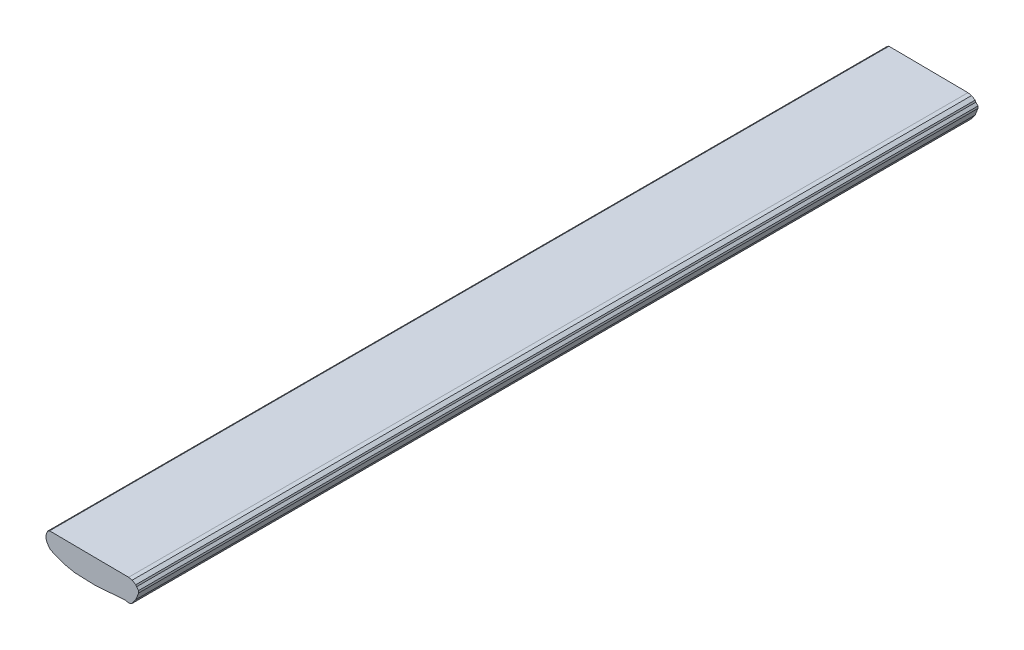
ISO-10303-21;
HEADER;
FILE_DESCRIPTION(('STEP AP214'),'2;1');
FILE_NAME('part.step','',(''),(''),'','','');
FILE_SCHEMA(('AUTOMOTIVE_DESIGN { 1 0 10303 214 1 1 1 1 }'));
ENDSEC;
DATA;
#1=APPLICATION_CONTEXT('core data for automotive mechanical design processes');
#2=APPLICATION_PROTOCOL_DEFINITION('international standard','automotive_design',2000,#1);
#3=PRODUCT_CONTEXT('',#1,'mechanical');
#4=PRODUCT('Part','Part','',(#3));
#5=PRODUCT_RELATED_PRODUCT_CATEGORY('part','',(#4));
#6=PRODUCT_DEFINITION_FORMATION('','',#4);
#7=PRODUCT_DEFINITION_CONTEXT('part definition',#1,'design');
#8=PRODUCT_DEFINITION('design','',#6,#7);
#9=PRODUCT_DEFINITION_SHAPE('','',#8);
#10=(LENGTH_UNIT() NAMED_UNIT(*) SI_UNIT(.MILLI.,.METRE.));
#11=(NAMED_UNIT(*) PLANE_ANGLE_UNIT() SI_UNIT($,.RADIAN.));
#12=(NAMED_UNIT(*) SI_UNIT($,.STERADIAN.) SOLID_ANGLE_UNIT());
#13=UNCERTAINTY_MEASURE_WITH_UNIT(LENGTH_MEASURE(1.E-05),#10,'distance_accuracy_value','');
#14=(GEOMETRIC_REPRESENTATION_CONTEXT(3) GLOBAL_UNCERTAINTY_ASSIGNED_CONTEXT((#13)) GLOBAL_UNIT_ASSIGNED_CONTEXT((#10,
#11,#12)) REPRESENTATION_CONTEXT('',''));
#15=CARTESIAN_POINT('',(0.,0.,0.));
#16=DIRECTION('',(0.,0.,1.));
#17=DIRECTION('',(1.,0.,0.));
#18=AXIS2_PLACEMENT_3D('',#15,#16,#17);
#19=CARTESIAN_POINT('',(575.,150.,-1160.));
#20=DIRECTION('',(-0.554700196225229,0.832050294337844,0.));
#21=DIRECTION('',(-0.832050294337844,-0.554700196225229,0.));
#22=AXIS2_PLACEMENT_3D('',#19,#20,#21);
#23=PLANE('',#22);
#24=DIRECTION('',(-0.832050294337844,-0.554700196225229,0.));
#25=VECTOR('',#24,1.);
#26=CARTESIAN_POINT('',(575.,150.,8.40000000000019));
#27=LINE('',#26,#25);
#28=CARTESIAN_POINT('',(575.,150.,8.40000000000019));
#29=VERTEX_POINT('',#28);
#30=CARTESIAN_POINT('',(572.,148.,8.40000000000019));
#31=VERTEX_POINT('',#30);
#32=EDGE_CURVE('E213',#29,#31,#27,.T.);
#33=ORIENTED_EDGE('',*,*,#32,.F.);
#34=DIRECTION('',(0.,0.,1.));
#35=VECTOR('',#34,1.);
#36=CARTESIAN_POINT('',(575.,150.,-1160.));
#37=LINE('',#36,#35);
#38=CARTESIAN_POINT('',(575.,150.,-1160.));
#39=VERTEX_POINT('',#38);
#40=EDGE_CURVE('E11',#39,#29,#37,.T.);
#41=ORIENTED_EDGE('',*,*,#40,.F.);
#42=DIRECTION('',(-0.832050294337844,-0.554700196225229,0.));
#43=VECTOR('',#42,1.);
#44=CARTESIAN_POINT('',(575.,150.,-1160.));
#45=LINE('',#44,#43);
#46=CARTESIAN_POINT('',(572.,148.,-1160.));
#47=VERTEX_POINT('',#46);
#48=EDGE_CURVE('E275',#39,#47,#45,.T.);
#49=ORIENTED_EDGE('',*,*,#48,.T.);
#50=DIRECTION('',(0.,0.,1.));
#51=VECTOR('',#50,1.);
#52=CARTESIAN_POINT('',(572.,148.,-1160.));
#53=LINE('',#52,#51);
#54=EDGE_CURVE('E35',#47,#31,#53,.T.);
#55=ORIENTED_EDGE('',*,*,#54,.T.);
#56=EDGE_LOOP('',(#33,#41,#49,#55));
#57=FACE_BOUND('',#56,.T.);
#58=ADVANCED_FACE('F32',(#57),#23,.T.);
#59=CARTESIAN_POINT('',(685.,149.,-1160.));
#60=DIRECTION('',(0.0090905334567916,0.999958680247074,0.));
#61=DIRECTION('',(-0.999958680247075,0.0090905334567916,0.));
#62=AXIS2_PLACEMENT_3D('',#59,#60,#61);
#63=PLANE('',#62);
#64=DIRECTION('',(-0.999958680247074,0.0090905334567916,0.));
#65=VECTOR('',#64,1.);
#66=CARTESIAN_POINT('',(685.,149.,8.40000000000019));
#67=LINE('',#66,#65);
#68=CARTESIAN_POINT('',(685.,149.,8.40000000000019));
#69=VERTEX_POINT('',#68);
#70=EDGE_CURVE('E273',#69,#29,#67,.T.);
#71=ORIENTED_EDGE('',*,*,#70,.F.);
#72=DIRECTION('',(0.,0.,1.));
#73=VECTOR('',#72,1.);
#74=CARTESIAN_POINT('',(685.,149.,-1160.));
#75=LINE('',#74,#73);
#76=CARTESIAN_POINT('',(685.,149.,-1160.));
#77=VERTEX_POINT('',#76);
#78=EDGE_CURVE('E41',#77,#69,#75,.T.);
#79=ORIENTED_EDGE('',*,*,#78,.F.);
#80=DIRECTION('',(-0.999958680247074,0.0090905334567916,0.));
#81=VECTOR('',#80,1.);
#82=CARTESIAN_POINT('',(685.,149.,-1160.));
#83=LINE('',#82,#81);
#84=EDGE_CURVE('E203',#77,#39,#83,.T.);
#85=ORIENTED_EDGE('',*,*,#84,.T.);
#86=ORIENTED_EDGE('',*,*,#40,.T.);
#87=EDGE_LOOP('',(#71,#79,#85,#86));
#88=FACE_BOUND('',#87,.T.);
#89=ADVANCED_FACE('F315',(#88),#63,.T.);
#90=CARTESIAN_POINT('',(690.,148.,-1160.));
#91=DIRECTION('',(0.196116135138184,0.98058067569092,0.));
#92=DIRECTION('',(-0.98058067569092,0.196116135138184,0.));
#93=AXIS2_PLACEMENT_3D('',#90,#91,#92);
#94=PLANE('',#93);
#95=DIRECTION('',(-0.98058067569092,0.196116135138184,0.));
#96=VECTOR('',#95,1.);
#97=CARTESIAN_POINT('',(690.,148.,8.40000000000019));
#98=LINE('',#97,#96);
#99=CARTESIAN_POINT('',(690.,148.,8.40000000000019));
#100=VERTEX_POINT('',#99);
#101=EDGE_CURVE('E190',#100,#69,#98,.T.);
#102=ORIENTED_EDGE('',*,*,#101,.F.);
#103=DIRECTION('',(0.,0.,1.));
#104=VECTOR('',#103,1.);
#105=CARTESIAN_POINT('',(690.,148.,-1160.));
#106=LINE('',#105,#104);
#107=CARTESIAN_POINT('',(690.,148.,-1160.));
#108=VERTEX_POINT('',#107);
#109=EDGE_CURVE('E185',#108,#100,#106,.T.);
#110=ORIENTED_EDGE('',*,*,#109,.F.);
#111=DIRECTION('',(-0.98058067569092,0.196116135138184,0.));
#112=VECTOR('',#111,1.);
#113=CARTESIAN_POINT('',(690.,148.,-1160.));
#114=LINE('',#113,#112);
#115=EDGE_CURVE('E188',#108,#77,#114,.T.);
#116=ORIENTED_EDGE('',*,*,#115,.T.);
#117=ORIENTED_EDGE('',*,*,#78,.T.);
#118=EDGE_LOOP('',(#102,#110,#116,#117));
#119=FACE_BOUND('',#118,.T.);
#120=ADVANCED_FACE('F187',(#119),#94,.T.);
#121=CARTESIAN_POINT('',(695.,145.,-1160.));
#122=DIRECTION('',(0.514495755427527,0.857492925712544,0.));
#123=DIRECTION('',(-0.857492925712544,0.514495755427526,0.));
#124=AXIS2_PLACEMENT_3D('',#121,#122,#123);
#125=PLANE('',#124);
#126=DIRECTION('',(-0.857492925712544,0.514495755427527,0.));
#127=VECTOR('',#126,1.);
#128=CARTESIAN_POINT('',(695.,145.,8.40000000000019));
#129=LINE('',#128,#127);
#130=CARTESIAN_POINT('',(695.,145.,8.40000000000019));
#131=VERTEX_POINT('',#130);
#132=EDGE_CURVE('E270',#131,#100,#129,.T.);
#133=ORIENTED_EDGE('',*,*,#132,.F.);
#134=DIRECTION('',(0.,0.,1.));
#135=VECTOR('',#134,1.);
#136=CARTESIAN_POINT('',(695.,145.,-1160.));
#137=LINE('',#136,#135);
#138=CARTESIAN_POINT('',(695.,145.,-1160.));
#139=VERTEX_POINT('',#138);
#140=EDGE_CURVE('E195',#139,#131,#137,.T.);
#141=ORIENTED_EDGE('',*,*,#140,.F.);
#142=DIRECTION('',(-0.857492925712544,0.514495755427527,0.));
#143=VECTOR('',#142,1.);
#144=CARTESIAN_POINT('',(695.,145.,-1160.));
#145=LINE('',#144,#143);
#146=EDGE_CURVE('E201',#139,#108,#145,.T.);
#147=ORIENTED_EDGE('',*,*,#146,.T.);
#148=ORIENTED_EDGE('',*,*,#109,.T.);
#149=EDGE_LOOP('',(#133,#141,#147,#148));
#150=FACE_BOUND('',#149,.T.);
#151=ADVANCED_FACE('F205',(#150),#125,.T.);
#152=CARTESIAN_POINT('',(696.,143.,-1160.));
#153=DIRECTION('',(0.894427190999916,0.447213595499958,0.));
#154=DIRECTION('',(-0.447213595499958,0.894427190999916,0.));
#155=AXIS2_PLACEMENT_3D('',#152,#153,#154);
#156=PLANE('',#155);
#157=DIRECTION('',(-0.447213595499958,0.894427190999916,0.));
#158=VECTOR('',#157,1.);
#159=CARTESIAN_POINT('',(696.,143.,8.40000000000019));
#160=LINE('',#159,#158);
#161=CARTESIAN_POINT('',(696.,143.,8.40000000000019));
#162=VERTEX_POINT('',#161);
#163=EDGE_CURVE('E267',#162,#131,#160,.T.);
#164=ORIENTED_EDGE('',*,*,#163,.F.);
#165=DIRECTION('',(0.,0.,1.));
#166=VECTOR('',#165,1.);
#167=CARTESIAN_POINT('',(696.,143.,-1160.));
#168=LINE('',#167,#166);
#169=CARTESIAN_POINT('',(696.,143.,-1160.));
#170=VERTEX_POINT('',#169);
#171=EDGE_CURVE('E279',#170,#162,#168,.T.);
#172=ORIENTED_EDGE('',*,*,#171,.F.);
#173=DIRECTION('',(-0.447213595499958,0.894427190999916,0.));
#174=VECTOR('',#173,1.);
#175=CARTESIAN_POINT('',(696.,143.,-1160.));
#176=LINE('',#175,#174);
#177=EDGE_CURVE('E206',#170,#139,#176,.T.);
#178=ORIENTED_EDGE('',*,*,#177,.T.);
#179=ORIENTED_EDGE('',*,*,#140,.T.);
#180=EDGE_LOOP('',(#164,#172,#178,#179));
#181=FACE_BOUND('',#180,.T.);
#182=ADVANCED_FACE('F328',(#181),#156,.T.);
#183=CARTESIAN_POINT('',(699.,140.,-1160.));
#184=DIRECTION('',(0.707106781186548,0.707106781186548,0.));
#185=DIRECTION('',(-0.707106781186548,0.707106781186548,0.));
#186=AXIS2_PLACEMENT_3D('',#183,#184,#185);
#187=PLANE('',#186);
#188=DIRECTION('',(-0.707106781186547,0.707106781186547,0.));
#189=VECTOR('',#188,1.);
#190=CARTESIAN_POINT('',(699.,140.,8.40000000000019));
#191=LINE('',#190,#189);
#192=CARTESIAN_POINT('',(699.,140.,8.40000000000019));
#193=VERTEX_POINT('',#192);
#194=EDGE_CURVE('E264',#193,#162,#191,.T.);
#195=ORIENTED_EDGE('',*,*,#194,.F.);
#196=DIRECTION('',(0.,0.,1.));
#197=VECTOR('',#196,1.);
#198=CARTESIAN_POINT('',(699.,140.,-1160.));
#199=LINE('',#198,#197);
#200=CARTESIAN_POINT('',(699.,140.,-1160.));
#201=VERTEX_POINT('',#200);
#202=EDGE_CURVE('E281',#201,#193,#199,.T.);
#203=ORIENTED_EDGE('',*,*,#202,.F.);
#204=DIRECTION('',(-0.707106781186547,0.707106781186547,0.));
#205=VECTOR('',#204,1.);
#206=CARTESIAN_POINT('',(699.,140.,-1160.));
#207=LINE('',#206,#205);
#208=EDGE_CURVE('E208',#201,#170,#207,.T.);
#209=ORIENTED_EDGE('',*,*,#208,.T.);
#210=ORIENTED_EDGE('',*,*,#171,.T.);
#211=EDGE_LOOP('',(#195,#203,#209,#210));
#212=FACE_BOUND('',#211,.T.);
#213=ADVANCED_FACE('F331',(#212),#187,.T.);
#214=CARTESIAN_POINT('',(699.,137.,-1160.));
#215=DIRECTION('',(1.,0.,0.));
#216=DIRECTION('',(0.,0.,-1.));
#217=AXIS2_PLACEMENT_3D('',#214,#215,#216);
#218=PLANE('',#217);
#219=DIRECTION('',(0.,1.,0.));
#220=VECTOR('',#219,1.);
#221=CARTESIAN_POINT('',(699.,137.,8.40000000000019));
#222=LINE('',#221,#220);
#223=CARTESIAN_POINT('',(699.,137.,8.40000000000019));
#224=VERTEX_POINT('',#223);
#225=EDGE_CURVE('E261',#224,#193,#222,.T.);
#226=ORIENTED_EDGE('',*,*,#225,.F.);
#227=DIRECTION('',(0.,0.,1.));
#228=VECTOR('',#227,1.);
#229=CARTESIAN_POINT('',(699.,137.,-1160.));
#230=LINE('',#229,#228);
#231=CARTESIAN_POINT('',(699.,137.,-1160.));
#232=VERTEX_POINT('',#231);
#233=EDGE_CURVE('E283',#232,#224,#230,.T.);
#234=ORIENTED_EDGE('',*,*,#233,.F.);
#235=DIRECTION('',(0.,1.,0.));
#236=VECTOR('',#235,1.);
#237=CARTESIAN_POINT('',(699.,137.,-1160.));
#238=LINE('',#237,#236);
#239=EDGE_CURVE('E594',#232,#201,#238,.T.);
#240=ORIENTED_EDGE('',*,*,#239,.T.);
#241=ORIENTED_EDGE('',*,*,#202,.T.);
#242=EDGE_LOOP('',(#226,#234,#240,#241));
#243=FACE_BOUND('',#242,.T.);
#244=ADVANCED_FACE('F335',(#243),#218,.T.);
#245=CARTESIAN_POINT('',(695.,127.,-1160.));
#246=DIRECTION('',(0.928476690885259,-0.371390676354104,0.));
#247=DIRECTION('',(0.371390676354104,0.928476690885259,0.));
#248=AXIS2_PLACEMENT_3D('',#245,#246,#247);
#249=PLANE('',#248);
#250=DIRECTION('',(0.371390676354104,0.928476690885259,0.));
#251=VECTOR('',#250,1.);
#252=CARTESIAN_POINT('',(695.,127.,8.40000000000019));
#253=LINE('',#252,#251);
#254=CARTESIAN_POINT('',(695.,127.,8.40000000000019));
#255=VERTEX_POINT('',#254);
#256=EDGE_CURVE('E258',#255,#224,#253,.T.);
#257=ORIENTED_EDGE('',*,*,#256,.F.);
#258=DIRECTION('',(0.,0.,1.));
#259=VECTOR('',#258,1.);
#260=CARTESIAN_POINT('',(695.,127.,-1160.));
#261=LINE('',#260,#259);
#262=CARTESIAN_POINT('',(695.,127.,-1160.));
#263=VERTEX_POINT('',#262);
#264=EDGE_CURVE('E285',#263,#255,#261,.T.);
#265=ORIENTED_EDGE('',*,*,#264,.F.);
#266=DIRECTION('',(0.371390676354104,0.928476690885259,0.));
#267=VECTOR('',#266,1.);
#268=CARTESIAN_POINT('',(695.,127.,-1160.));
#269=LINE('',#268,#267);
#270=EDGE_CURVE('E590',#263,#232,#269,.T.);
#271=ORIENTED_EDGE('',*,*,#270,.T.);
#272=ORIENTED_EDGE('',*,*,#233,.T.);
#273=EDGE_LOOP('',(#257,#265,#271,#272));
#274=FACE_BOUND('',#273,.T.);
#275=ADVANCED_FACE('F339',(#274),#249,.T.);
#276=CARTESIAN_POINT('',(689.,119.,-1160.));
#277=DIRECTION('',(0.799999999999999,-0.600000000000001,0.));
#278=DIRECTION('',(0.600000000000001,0.799999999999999,0.));
#279=AXIS2_PLACEMENT_3D('',#276,#277,#278);
#280=PLANE('',#279);
#281=DIRECTION('',(0.600000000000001,0.799999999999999,0.));
#282=VECTOR('',#281,1.);
#283=CARTESIAN_POINT('',(689.,119.,8.40000000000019));
#284=LINE('',#283,#282);
#285=CARTESIAN_POINT('',(689.,119.,8.40000000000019));
#286=VERTEX_POINT('',#285);
#287=EDGE_CURVE('E255',#286,#255,#284,.T.);
#288=ORIENTED_EDGE('',*,*,#287,.F.);
#289=DIRECTION('',(0.,0.,1.));
#290=VECTOR('',#289,1.);
#291=CARTESIAN_POINT('',(689.,119.,-1160.));
#292=LINE('',#291,#290);
#293=CARTESIAN_POINT('',(689.,119.,-1160.));
#294=VERTEX_POINT('',#293);
#295=EDGE_CURVE('E287',#294,#286,#292,.T.);
#296=ORIENTED_EDGE('',*,*,#295,.F.);
#297=DIRECTION('',(0.600000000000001,0.799999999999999,0.));
#298=VECTOR('',#297,1.);
#299=CARTESIAN_POINT('',(689.,119.,-1160.));
#300=LINE('',#299,#298);
#301=EDGE_CURVE('E601',#294,#263,#300,.T.);
#302=ORIENTED_EDGE('',*,*,#301,.T.);
#303=ORIENTED_EDGE('',*,*,#264,.T.);
#304=EDGE_LOOP('',(#288,#296,#302,#303));
#305=FACE_BOUND('',#304,.T.);
#306=ADVANCED_FACE('F343',(#305),#280,.T.);
#307=CARTESIAN_POINT('',(685.,118.,-1160.));
#308=DIRECTION('',(0.242535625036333,-0.970142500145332,0.));
#309=DIRECTION('',(0.970142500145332,0.242535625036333,0.));
#310=AXIS2_PLACEMENT_3D('',#307,#308,#309);
#311=PLANE('',#310);
#312=DIRECTION('',(0.970142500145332,0.242535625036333,0.));
#313=VECTOR('',#312,1.);
#314=CARTESIAN_POINT('',(685.,118.,8.40000000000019));
#315=LINE('',#314,#313);
#316=CARTESIAN_POINT('',(685.,118.,8.40000000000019));
#317=VERTEX_POINT('',#316);
#318=EDGE_CURVE('E252',#317,#286,#315,.T.);
#319=ORIENTED_EDGE('',*,*,#318,.F.);
#320=DIRECTION('',(0.,0.,1.));
#321=VECTOR('',#320,1.);
#322=CARTESIAN_POINT('',(685.,118.,-1160.));
#323=LINE('',#322,#321);
#324=CARTESIAN_POINT('',(685.,118.,-1160.));
#325=VERTEX_POINT('',#324);
#326=EDGE_CURVE('E289',#325,#317,#323,.T.);
#327=ORIENTED_EDGE('',*,*,#326,.F.);
#328=DIRECTION('',(0.970142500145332,0.242535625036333,0.));
#329=VECTOR('',#328,1.);
#330=CARTESIAN_POINT('',(685.,118.,-1160.));
#331=LINE('',#330,#329);
#332=EDGE_CURVE('E583',#325,#294,#331,.T.);
#333=ORIENTED_EDGE('',*,*,#332,.T.);
#334=ORIENTED_EDGE('',*,*,#295,.T.);
#335=EDGE_LOOP('',(#319,#327,#333,#334));
#336=FACE_BOUND('',#335,.T.);
#337=ADVANCED_FACE('F347',(#336),#311,.T.);
#338=CARTESIAN_POINT('',(681.,119.,-1160.));
#339=DIRECTION('',(-0.242535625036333,-0.970142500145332,0.));
#340=DIRECTION('',(0.970142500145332,-0.242535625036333,0.));
#341=AXIS2_PLACEMENT_3D('',#338,#339,#340);
#342=PLANE('',#341);
#343=DIRECTION('',(0.970142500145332,-0.242535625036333,0.));
#344=VECTOR('',#343,1.);
#345=CARTESIAN_POINT('',(681.,119.,8.40000000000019));
#346=LINE('',#345,#344);
#347=CARTESIAN_POINT('',(681.,119.,8.40000000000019));
#348=VERTEX_POINT('',#347);
#349=EDGE_CURVE('E249',#348,#317,#346,.T.);
#350=ORIENTED_EDGE('',*,*,#349,.F.);
#351=DIRECTION('',(0.,0.,1.));
#352=VECTOR('',#351,1.);
#353=CARTESIAN_POINT('',(681.,119.,-1160.));
#354=LINE('',#353,#352);
#355=CARTESIAN_POINT('',(681.,119.,-1160.));
#356=VERTEX_POINT('',#355);
#357=EDGE_CURVE('E291',#356,#348,#354,.T.);
#358=ORIENTED_EDGE('',*,*,#357,.F.);
#359=DIRECTION('',(0.970142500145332,-0.242535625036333,0.));
#360=VECTOR('',#359,1.);
#361=CARTESIAN_POINT('',(681.,119.,-1160.));
#362=LINE('',#361,#360);
#363=EDGE_CURVE('E579',#356,#325,#362,.T.);
#364=ORIENTED_EDGE('',*,*,#363,.T.);
#365=ORIENTED_EDGE('',*,*,#326,.T.);
#366=EDGE_LOOP('',(#350,#358,#364,#365));
#367=FACE_BOUND('',#366,.T.);
#368=ADVANCED_FACE('F351',(#367),#342,.T.);
#369=CARTESIAN_POINT('',(637.,116.,-1160.));
#370=DIRECTION('',(0.0680238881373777,-0.99768369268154,0.));
#371=DIRECTION('',(0.99768369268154,0.0680238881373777,0.));
#372=AXIS2_PLACEMENT_3D('',#369,#370,#371);
#373=PLANE('',#372);
#374=DIRECTION('',(0.99768369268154,0.0680238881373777,0.));
#375=VECTOR('',#374,1.);
#376=CARTESIAN_POINT('',(637.,116.,8.40000000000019));
#377=LINE('',#376,#375);
#378=CARTESIAN_POINT('',(637.,116.,8.40000000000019));
#379=VERTEX_POINT('',#378);
#380=EDGE_CURVE('E246',#379,#348,#377,.T.);
#381=ORIENTED_EDGE('',*,*,#380,.F.);
#382=DIRECTION('',(0.,0.,1.));
#383=VECTOR('',#382,1.);
#384=CARTESIAN_POINT('',(637.,116.,-1160.));
#385=LINE('',#384,#383);
#386=CARTESIAN_POINT('',(637.,116.,-1160.));
#387=VERTEX_POINT('',#386);
#388=EDGE_CURVE('E293',#387,#379,#385,.T.);
#389=ORIENTED_EDGE('',*,*,#388,.F.);
#390=DIRECTION('',(0.99768369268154,0.0680238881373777,0.));
#391=VECTOR('',#390,1.);
#392=CARTESIAN_POINT('',(637.,116.,-1160.));
#393=LINE('',#392,#391);
#394=EDGE_CURVE('E605',#387,#356,#393,.T.);
#395=ORIENTED_EDGE('',*,*,#394,.T.);
#396=ORIENTED_EDGE('',*,*,#357,.T.);
#397=EDGE_LOOP('',(#381,#389,#395,#396));
#398=FACE_BOUND('',#397,.T.);
#399=ADVANCED_FACE('F355',(#398),#373,.T.);
#400=CARTESIAN_POINT('',(610.,117.,-1160.));
#401=DIRECTION('',(-0.0370116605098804,-0.999314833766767,0.));
#402=DIRECTION('',(0.999314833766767,-0.0370116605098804,0.));
#403=AXIS2_PLACEMENT_3D('',#400,#401,#402);
#404=PLANE('',#403);
#405=DIRECTION('',(0.999314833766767,-0.0370116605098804,0.));
#406=VECTOR('',#405,1.);
#407=CARTESIAN_POINT('',(610.,117.,8.40000000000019));
#408=LINE('',#407,#406);
#409=CARTESIAN_POINT('',(610.,117.,8.40000000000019));
#410=VERTEX_POINT('',#409);
#411=EDGE_CURVE('E243',#410,#379,#408,.T.);
#412=ORIENTED_EDGE('',*,*,#411,.F.);
#413=DIRECTION('',(0.,0.,1.));
#414=VECTOR('',#413,1.);
#415=CARTESIAN_POINT('',(610.,117.,-1160.));
#416=LINE('',#415,#414);
#417=CARTESIAN_POINT('',(610.,117.,-1160.));
#418=VERTEX_POINT('',#417);
#419=EDGE_CURVE('E295',#418,#410,#416,.T.);
#420=ORIENTED_EDGE('',*,*,#419,.F.);
#421=DIRECTION('',(0.999314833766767,-0.0370116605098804,0.));
#422=VECTOR('',#421,1.);
#423=CARTESIAN_POINT('',(610.,117.,-1160.));
#424=LINE('',#423,#422);
#425=EDGE_CURVE('E572',#418,#387,#424,.T.);
#426=ORIENTED_EDGE('',*,*,#425,.T.);
#427=ORIENTED_EDGE('',*,*,#388,.T.);
#428=EDGE_LOOP('',(#412,#420,#426,#427));
#429=FACE_BOUND('',#428,.T.);
#430=ADVANCED_FACE('F359',(#429),#404,.T.);
#431=CARTESIAN_POINT('',(596.,120.,-1160.));
#432=DIRECTION('',(-0.209529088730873,-0.977802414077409,0.));
#433=DIRECTION('',(0.97780241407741,-0.209529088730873,0.));
#434=AXIS2_PLACEMENT_3D('',#431,#432,#433);
#435=PLANE('',#434);
#436=DIRECTION('',(0.97780241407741,-0.209529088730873,0.));
#437=VECTOR('',#436,1.);
#438=CARTESIAN_POINT('',(596.,120.,8.40000000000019));
#439=LINE('',#438,#437);
#440=CARTESIAN_POINT('',(596.,120.,8.40000000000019));
#441=VERTEX_POINT('',#440);
#442=EDGE_CURVE('E240',#441,#410,#439,.T.);
#443=ORIENTED_EDGE('',*,*,#442,.F.);
#444=DIRECTION('',(0.,0.,1.));
#445=VECTOR('',#444,1.);
#446=CARTESIAN_POINT('',(596.,120.,-1160.));
#447=LINE('',#446,#445);
#448=CARTESIAN_POINT('',(596.,120.,-1160.));
#449=VERTEX_POINT('',#448);
#450=EDGE_CURVE('E297',#449,#441,#447,.T.);
#451=ORIENTED_EDGE('',*,*,#450,.F.);
#452=DIRECTION('',(0.97780241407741,-0.209529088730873,0.));
#453=VECTOR('',#452,1.);
#454=CARTESIAN_POINT('',(596.,120.,-1160.));
#455=LINE('',#454,#453);
#456=EDGE_CURVE('E568',#449,#418,#455,.T.);
#457=ORIENTED_EDGE('',*,*,#456,.T.);
#458=ORIENTED_EDGE('',*,*,#419,.T.);
#459=EDGE_LOOP('',(#443,#451,#457,#458));
#460=FACE_BOUND('',#459,.T.);
#461=ADVANCED_FACE('F363',(#460),#435,.T.);
#462=CARTESIAN_POINT('',(585.,124.,-1160.));
#463=DIRECTION('',(-0.341743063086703,-0.939793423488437,0.));
#464=DIRECTION('',(0.939793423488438,-0.341743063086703,0.));
#465=AXIS2_PLACEMENT_3D('',#462,#463,#464);
#466=PLANE('',#465);
#467=DIRECTION('',(0.939793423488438,-0.341743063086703,0.));
#468=VECTOR('',#467,1.);
#469=CARTESIAN_POINT('',(585.,124.,8.40000000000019));
#470=LINE('',#469,#468);
#471=CARTESIAN_POINT('',(585.,124.,8.40000000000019));
#472=VERTEX_POINT('',#471);
#473=EDGE_CURVE('E237',#472,#441,#470,.T.);
#474=ORIENTED_EDGE('',*,*,#473,.F.);
#475=DIRECTION('',(0.,0.,1.));
#476=VECTOR('',#475,1.);
#477=CARTESIAN_POINT('',(585.,124.,-1160.));
#478=LINE('',#477,#476);
#479=CARTESIAN_POINT('',(585.,124.,-1160.));
#480=VERTEX_POINT('',#479);
#481=EDGE_CURVE('E299',#480,#472,#478,.T.);
#482=ORIENTED_EDGE('',*,*,#481,.F.);
#483=DIRECTION('',(0.939793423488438,-0.341743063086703,0.));
#484=VECTOR('',#483,1.);
#485=CARTESIAN_POINT('',(585.,124.,-1160.));
#486=LINE('',#485,#484);
#487=EDGE_CURVE('E609',#480,#449,#486,.T.);
#488=ORIENTED_EDGE('',*,*,#487,.T.);
#489=ORIENTED_EDGE('',*,*,#450,.T.);
#490=EDGE_LOOP('',(#474,#482,#488,#489));
#491=FACE_BOUND('',#490,.T.);
#492=ADVANCED_FACE('F367',(#491),#466,.T.);
#493=CARTESIAN_POINT('',(580.,126.,-1160.));
#494=DIRECTION('',(-0.371390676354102,-0.92847669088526,0.));
#495=DIRECTION('',(0.92847669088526,-0.371390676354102,0.));
#496=AXIS2_PLACEMENT_3D('',#493,#494,#495);
#497=PLANE('',#496);
#498=DIRECTION('',(0.92847669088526,-0.371390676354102,0.));
#499=VECTOR('',#498,1.);
#500=CARTESIAN_POINT('',(580.,126.,8.40000000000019));
#501=LINE('',#500,#499);
#502=CARTESIAN_POINT('',(580.,126.,8.40000000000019));
#503=VERTEX_POINT('',#502);
#504=EDGE_CURVE('E234',#503,#472,#501,.T.);
#505=ORIENTED_EDGE('',*,*,#504,.F.);
#506=DIRECTION('',(0.,0.,1.));
#507=VECTOR('',#506,1.);
#508=CARTESIAN_POINT('',(580.,126.,-1160.));
#509=LINE('',#508,#507);
#510=CARTESIAN_POINT('',(580.,126.,-1160.));
#511=VERTEX_POINT('',#510);
#512=EDGE_CURVE('E301',#511,#503,#509,.T.);
#513=ORIENTED_EDGE('',*,*,#512,.F.);
#514=DIRECTION('',(0.92847669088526,-0.371390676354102,0.));
#515=VECTOR('',#514,1.);
#516=CARTESIAN_POINT('',(580.,126.,-1160.));
#517=LINE('',#516,#515);
#518=EDGE_CURVE('E561',#511,#480,#517,.T.);
#519=ORIENTED_EDGE('',*,*,#518,.T.);
#520=ORIENTED_EDGE('',*,*,#481,.T.);
#521=EDGE_LOOP('',(#505,#513,#519,#520));
#522=FACE_BOUND('',#521,.T.);
#523=ADVANCED_FACE('F371',(#522),#497,.T.);
#524=CARTESIAN_POINT('',(576.,128.,-1160.));
#525=DIRECTION('',(-0.447213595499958,-0.894427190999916,0.));
#526=DIRECTION('',(0.894427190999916,-0.447213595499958,0.));
#527=AXIS2_PLACEMENT_3D('',#524,#525,#526);
#528=PLANE('',#527);
#529=DIRECTION('',(0.894427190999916,-0.447213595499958,0.));
#530=VECTOR('',#529,1.);
#531=CARTESIAN_POINT('',(576.,128.,8.40000000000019));
#532=LINE('',#531,#530);
#533=CARTESIAN_POINT('',(576.,128.,8.40000000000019));
#534=VERTEX_POINT('',#533);
#535=EDGE_CURVE('E231',#534,#503,#532,.T.);
#536=ORIENTED_EDGE('',*,*,#535,.F.);
#537=DIRECTION('',(0.,0.,1.));
#538=VECTOR('',#537,1.);
#539=CARTESIAN_POINT('',(576.,128.,-1160.));
#540=LINE('',#539,#538);
#541=CARTESIAN_POINT('',(576.,128.,-1160.));
#542=VERTEX_POINT('',#541);
#543=EDGE_CURVE('E303',#542,#534,#540,.T.);
#544=ORIENTED_EDGE('',*,*,#543,.F.);
#545=DIRECTION('',(0.894427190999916,-0.447213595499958,0.));
#546=VECTOR('',#545,1.);
#547=CARTESIAN_POINT('',(576.,128.,-1160.));
#548=LINE('',#547,#546);
#549=EDGE_CURVE('E557',#542,#511,#548,.T.);
#550=ORIENTED_EDGE('',*,*,#549,.T.);
#551=ORIENTED_EDGE('',*,*,#512,.T.);
#552=EDGE_LOOP('',(#536,#544,#550,#551));
#553=FACE_BOUND('',#552,.T.);
#554=ADVANCED_FACE('F375',(#553),#528,.T.);
#555=CARTESIAN_POINT('',(574.,130.,-1160.));
#556=DIRECTION('',(-0.707106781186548,-0.707106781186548,0.));
#557=DIRECTION('',(0.707106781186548,-0.707106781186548,0.));
#558=AXIS2_PLACEMENT_3D('',#555,#556,#557);
#559=PLANE('',#558);
#560=DIRECTION('',(0.707106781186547,-0.707106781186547,0.));
#561=VECTOR('',#560,1.);
#562=CARTESIAN_POINT('',(574.,130.,8.40000000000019));
#563=LINE('',#562,#561);
#564=CARTESIAN_POINT('',(574.,130.,8.40000000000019));
#565=VERTEX_POINT('',#564);
#566=EDGE_CURVE('E228',#565,#534,#563,.T.);
#567=ORIENTED_EDGE('',*,*,#566,.F.);
#568=DIRECTION('',(0.,0.,1.));
#569=VECTOR('',#568,1.);
#570=CARTESIAN_POINT('',(574.,130.,-1160.));
#571=LINE('',#570,#569);
#572=CARTESIAN_POINT('',(574.,130.,-1160.));
#573=VERTEX_POINT('',#572);
#574=EDGE_CURVE('E305',#573,#565,#571,.T.);
#575=ORIENTED_EDGE('',*,*,#574,.F.);
#576=DIRECTION('',(0.707106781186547,-0.707106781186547,0.));
#577=VECTOR('',#576,1.);
#578=CARTESIAN_POINT('',(574.,130.,-1160.));
#579=LINE('',#578,#577);
#580=EDGE_CURVE('E613',#573,#542,#579,.T.);
#581=ORIENTED_EDGE('',*,*,#580,.T.);
#582=ORIENTED_EDGE('',*,*,#543,.T.);
#583=EDGE_LOOP('',(#567,#575,#581,#582));
#584=FACE_BOUND('',#583,.T.);
#585=ADVANCED_FACE('F379',(#584),#559,.T.);
#586=CARTESIAN_POINT('',(571.,135.,-1160.));
#587=DIRECTION('',(-0.857492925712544,-0.514495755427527,0.));
#588=DIRECTION('',(0.514495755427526,-0.857492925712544,0.));
#589=AXIS2_PLACEMENT_3D('',#586,#587,#588);
#590=PLANE('',#589);
#591=DIRECTION('',(0.514495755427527,-0.857492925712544,0.));
#592=VECTOR('',#591,1.);
#593=CARTESIAN_POINT('',(571.,135.,8.40000000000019));
#594=LINE('',#593,#592);
#595=CARTESIAN_POINT('',(571.,135.,8.40000000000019));
#596=VERTEX_POINT('',#595);
#597=EDGE_CURVE('E225',#596,#565,#594,.T.);
#598=ORIENTED_EDGE('',*,*,#597,.F.);
#599=DIRECTION('',(0.,0.,1.));
#600=VECTOR('',#599,1.);
#601=CARTESIAN_POINT('',(571.,135.,-1160.));
#602=LINE('',#601,#600);
#603=CARTESIAN_POINT('',(571.,135.,-1160.));
#604=VERTEX_POINT('',#603);
#605=EDGE_CURVE('E307',#604,#596,#602,.T.);
#606=ORIENTED_EDGE('',*,*,#605,.F.);
#607=DIRECTION('',(0.514495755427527,-0.857492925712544,0.));
#608=VECTOR('',#607,1.);
#609=CARTESIAN_POINT('',(571.,135.,-1160.));
#610=LINE('',#609,#608);
#611=EDGE_CURVE('E550',#604,#573,#610,.T.);
#612=ORIENTED_EDGE('',*,*,#611,.T.);
#613=ORIENTED_EDGE('',*,*,#574,.T.);
#614=EDGE_LOOP('',(#598,#606,#612,#613));
#615=FACE_BOUND('',#614,.T.);
#616=ADVANCED_FACE('F383',(#615),#590,.T.);
#617=CARTESIAN_POINT('',(570.,138.,-1160.));
#618=DIRECTION('',(-0.948683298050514,-0.316227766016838,0.));
#619=DIRECTION('',(0.316227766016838,-0.948683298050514,0.));
#620=AXIS2_PLACEMENT_3D('',#617,#618,#619);
#621=PLANE('',#620);
#622=DIRECTION('',(0.316227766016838,-0.948683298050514,0.));
#623=VECTOR('',#622,1.);
#624=CARTESIAN_POINT('',(570.,138.,8.40000000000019));
#625=LINE('',#624,#623);
#626=CARTESIAN_POINT('',(570.,138.,8.40000000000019));
#627=VERTEX_POINT('',#626);
#628=EDGE_CURVE('E222',#627,#596,#625,.T.);
#629=ORIENTED_EDGE('',*,*,#628,.F.);
#630=DIRECTION('',(0.,0.,1.));
#631=VECTOR('',#630,1.);
#632=CARTESIAN_POINT('',(570.,138.,-1160.));
#633=LINE('',#632,#631);
#634=CARTESIAN_POINT('',(570.,138.,-1160.));
#635=VERTEX_POINT('',#634);
#636=EDGE_CURVE('E309',#635,#627,#633,.T.);
#637=ORIENTED_EDGE('',*,*,#636,.F.);
#638=DIRECTION('',(0.316227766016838,-0.948683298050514,0.));
#639=VECTOR('',#638,1.);
#640=CARTESIAN_POINT('',(570.,138.,-1160.));
#641=LINE('',#640,#639);
#642=EDGE_CURVE('E546',#635,#604,#641,.T.);
#643=ORIENTED_EDGE('',*,*,#642,.T.);
#644=ORIENTED_EDGE('',*,*,#605,.T.);
#645=EDGE_LOOP('',(#629,#637,#643,#644));
#646=FACE_BOUND('',#645,.T.);
#647=ADVANCED_FACE('F387',(#646),#621,.T.);
#648=CARTESIAN_POINT('',(570.,142.,-1160.));
#649=DIRECTION('',(-1.,0.,0.));
#650=DIRECTION('',(0.,0.,1.));
#651=AXIS2_PLACEMENT_3D('',#648,#649,#650);
#652=PLANE('',#651);
#653=DIRECTION('',(0.,-1.,0.));
#654=VECTOR('',#653,1.);
#655=CARTESIAN_POINT('',(570.,142.,8.40000000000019));
#656=LINE('',#655,#654);
#657=CARTESIAN_POINT('',(570.,142.,8.40000000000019));
#658=VERTEX_POINT('',#657);
#659=EDGE_CURVE('E219',#658,#627,#656,.T.);
#660=ORIENTED_EDGE('',*,*,#659,.F.);
#661=DIRECTION('',(0.,0.,1.));
#662=VECTOR('',#661,1.);
#663=CARTESIAN_POINT('',(570.,142.,-1160.));
#664=LINE('',#663,#662);
#665=CARTESIAN_POINT('',(570.,142.,-1160.));
#666=VERTEX_POINT('',#665);
#667=EDGE_CURVE('E310',#666,#658,#664,.T.);
#668=ORIENTED_EDGE('',*,*,#667,.F.);
#669=DIRECTION('',(0.,-1.,0.));
#670=VECTOR('',#669,1.);
#671=CARTESIAN_POINT('',(570.,142.,-1160.));
#672=LINE('',#671,#670);
#673=EDGE_CURVE('E617',#666,#635,#672,.T.);
#674=ORIENTED_EDGE('',*,*,#673,.T.);
#675=ORIENTED_EDGE('',*,*,#636,.T.);
#676=EDGE_LOOP('',(#660,#668,#674,#675));
#677=FACE_BOUND('',#676,.T.);
#678=ADVANCED_FACE('F391',(#677),#652,.T.);
#679=CARTESIAN_POINT('',(572.,148.,-1160.));
#680=DIRECTION('',(-0.948683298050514,0.316227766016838,0.));
#681=DIRECTION('',(-0.316227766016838,-0.948683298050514,0.));
#682=AXIS2_PLACEMENT_3D('',#679,#680,#681);
#683=PLANE('',#682);
#684=DIRECTION('',(-0.316227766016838,-0.948683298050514,0.));
#685=VECTOR('',#684,1.);
#686=CARTESIAN_POINT('',(572.,148.,8.40000000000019));
#687=LINE('',#686,#685);
#688=EDGE_CURVE('E216',#31,#658,#687,.T.);
#689=ORIENTED_EDGE('',*,*,#688,.F.);
#690=ORIENTED_EDGE('',*,*,#54,.F.);
#691=DIRECTION('',(-0.316227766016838,-0.948683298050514,0.));
#692=VECTOR('',#691,1.);
#693=CARTESIAN_POINT('',(572.,148.,-1160.));
#694=LINE('',#693,#692);
#695=EDGE_CURVE('E619',#47,#666,#694,.T.);
#696=ORIENTED_EDGE('',*,*,#695,.T.);
#697=ORIENTED_EDGE('',*,*,#667,.T.);
#698=EDGE_LOOP('',(#689,#690,#696,#697));
#699=FACE_BOUND('',#698,.T.);
#700=ADVANCED_FACE('F312',(#699),#683,.T.);
#701=CARTESIAN_POINT('',(565.714285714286,143.809523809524,-1160.));
#702=DIRECTION('',(0.,0.,1.));
#703=DIRECTION('',(1.,0.,0.));
#704=AXIS2_PLACEMENT_3D('',#701,#702,#703);
#705=PLANE('',#704);
#706=ORIENTED_EDGE('',*,*,#48,.F.);
#707=ORIENTED_EDGE('',*,*,#84,.F.);
#708=ORIENTED_EDGE('',*,*,#115,.F.);
#709=ORIENTED_EDGE('',*,*,#146,.F.);
#710=ORIENTED_EDGE('',*,*,#177,.F.);
#711=ORIENTED_EDGE('',*,*,#208,.F.);
#712=ORIENTED_EDGE('',*,*,#239,.F.);
#713=ORIENTED_EDGE('',*,*,#270,.F.);
#714=ORIENTED_EDGE('',*,*,#301,.F.);
#715=ORIENTED_EDGE('',*,*,#332,.F.);
#716=ORIENTED_EDGE('',*,*,#363,.F.);
#717=ORIENTED_EDGE('',*,*,#394,.F.);
#718=ORIENTED_EDGE('',*,*,#425,.F.);
#719=ORIENTED_EDGE('',*,*,#456,.F.);
#720=ORIENTED_EDGE('',*,*,#487,.F.);
#721=ORIENTED_EDGE('',*,*,#518,.F.);
#722=ORIENTED_EDGE('',*,*,#549,.F.);
#723=ORIENTED_EDGE('',*,*,#580,.F.);
#724=ORIENTED_EDGE('',*,*,#611,.F.);
#725=ORIENTED_EDGE('',*,*,#642,.F.);
#726=ORIENTED_EDGE('',*,*,#673,.F.);
#727=ORIENTED_EDGE('',*,*,#695,.F.);
#728=EDGE_LOOP('',(#706,#707,#708,#709,#710,#711,#712,#713,#714,#715,#716,#717,#718,#719,#720,
#721,#722,#723,#724,#725,#726,#727));
#729=FACE_BOUND('',#728,.T.);
#730=ADVANCED_FACE('F199',(#729),#705,.F.);
#731=CARTESIAN_POINT('',(565.714285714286,143.809523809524,8.40000000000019));
#732=DIRECTION('',(0.,0.,1.));
#733=DIRECTION('',(1.,0.,0.));
#734=AXIS2_PLACEMENT_3D('',#731,#732,#733);
#735=PLANE('',#734);
#736=ORIENTED_EDGE('',*,*,#32,.T.);
#737=ORIENTED_EDGE('',*,*,#688,.T.);
#738=ORIENTED_EDGE('',*,*,#659,.T.);
#739=ORIENTED_EDGE('',*,*,#628,.T.);
#740=ORIENTED_EDGE('',*,*,#597,.T.);
#741=ORIENTED_EDGE('',*,*,#566,.T.);
#742=ORIENTED_EDGE('',*,*,#535,.T.);
#743=ORIENTED_EDGE('',*,*,#504,.T.);
#744=ORIENTED_EDGE('',*,*,#473,.T.);
#745=ORIENTED_EDGE('',*,*,#442,.T.);
#746=ORIENTED_EDGE('',*,*,#411,.T.);
#747=ORIENTED_EDGE('',*,*,#380,.T.);
#748=ORIENTED_EDGE('',*,*,#349,.T.);
#749=ORIENTED_EDGE('',*,*,#318,.T.);
#750=ORIENTED_EDGE('',*,*,#287,.T.);
#751=ORIENTED_EDGE('',*,*,#256,.T.);
#752=ORIENTED_EDGE('',*,*,#225,.T.);
#753=ORIENTED_EDGE('',*,*,#194,.T.);
#754=ORIENTED_EDGE('',*,*,#163,.T.);
#755=ORIENTED_EDGE('',*,*,#132,.T.);
#756=ORIENTED_EDGE('',*,*,#101,.T.);
#757=ORIENTED_EDGE('',*,*,#70,.T.);
#758=EDGE_LOOP('',(#736,#737,#738,#739,#740,#741,#742,#743,#744,#745,#746,#747,#748,#749,#750,
#751,#752,#753,#754,#755,#756,#757));
#759=FACE_BOUND('',#758,.T.);
#760=ADVANCED_FACE('F314',(#759),#735,.T.);
#761=CLOSED_SHELL('',(#58,#89,#120,#151,#182,#213,#244,#275,#306,#337,#368,#399,#430,#461,#492,
#523,#554,#585,#616,#647,#678,#700,#730,#760));
#762=MANIFOLD_SOLID_BREP('B2',#761);
#763=ADVANCED_BREP_SHAPE_REPRESENTATION('',(#18,#762),#14);
#764=SHAPE_DEFINITION_REPRESENTATION(#9,#763);
ENDSEC;
END-ISO-10303-21;
